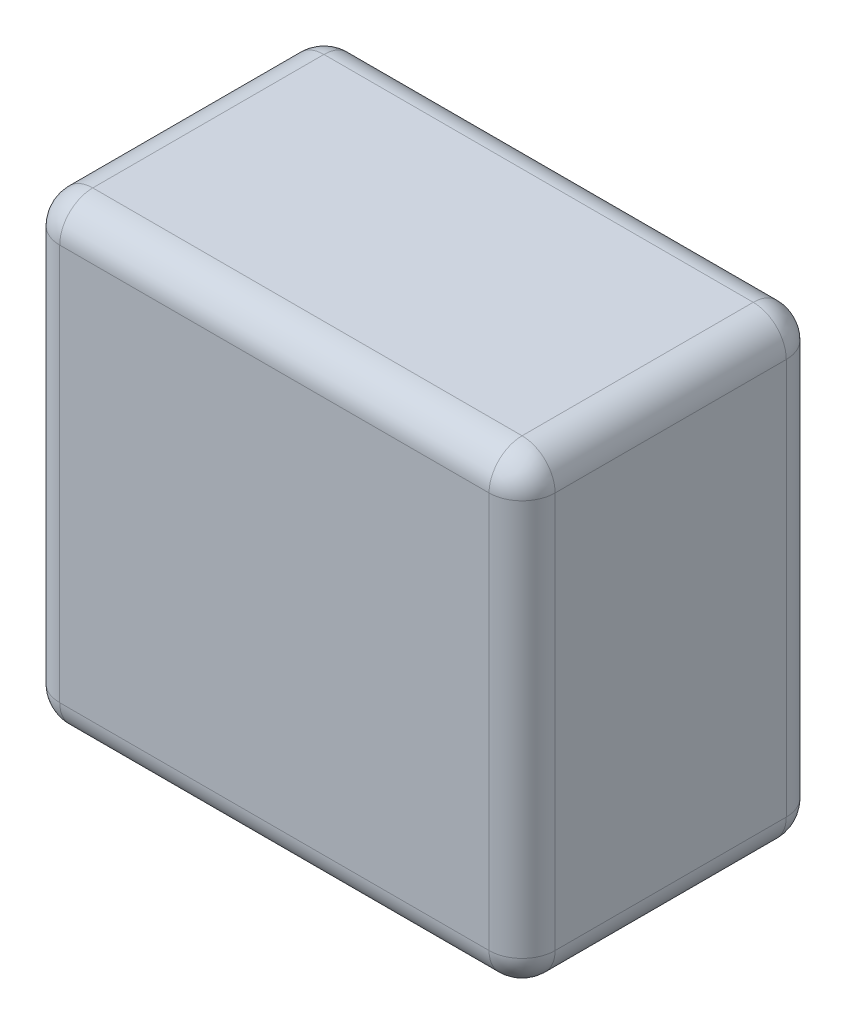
from build123d import *

# Parameters (mm, degrees)
SKETCH1_W           = 30
SKETCH1_H           = 18
BOSS_EXTRUDE1_DEPTH = 28
FILLET1_R           = 2


with BuildPart() as part:
    # Sketch1 → Boss-Extrude1 (new body)
    with BuildSketch(Plane(origin=(0, 0, 0), x_dir=(1, 0, 0), z_dir=(0, 1, 0))):
        with Locations((15, 9)):
            Rectangle(SKETCH1_W, SKETCH1_H)
    extrude(amount=BOSS_EXTRUDE1_DEPTH)

    # Fillet1
    fillet1_edges = [part.edges().sort_by_distance(p)[0] for p in [
        (30, 28, -9),
        (15, 28, -18),
        (0, 28, -9),
        (15, 0, -18),
        (30, 0, -9),
        (15, 0, 0),
        (0, 0, -9),
        (15, 28, 0),
        (0, 14, -18),
        (30, 14, -18),
        (30, 14, 0),
        (0, 14, 0),
    ]]
    fillet(fillet1_edges, radius=FILLET1_R)


solid = part.part
